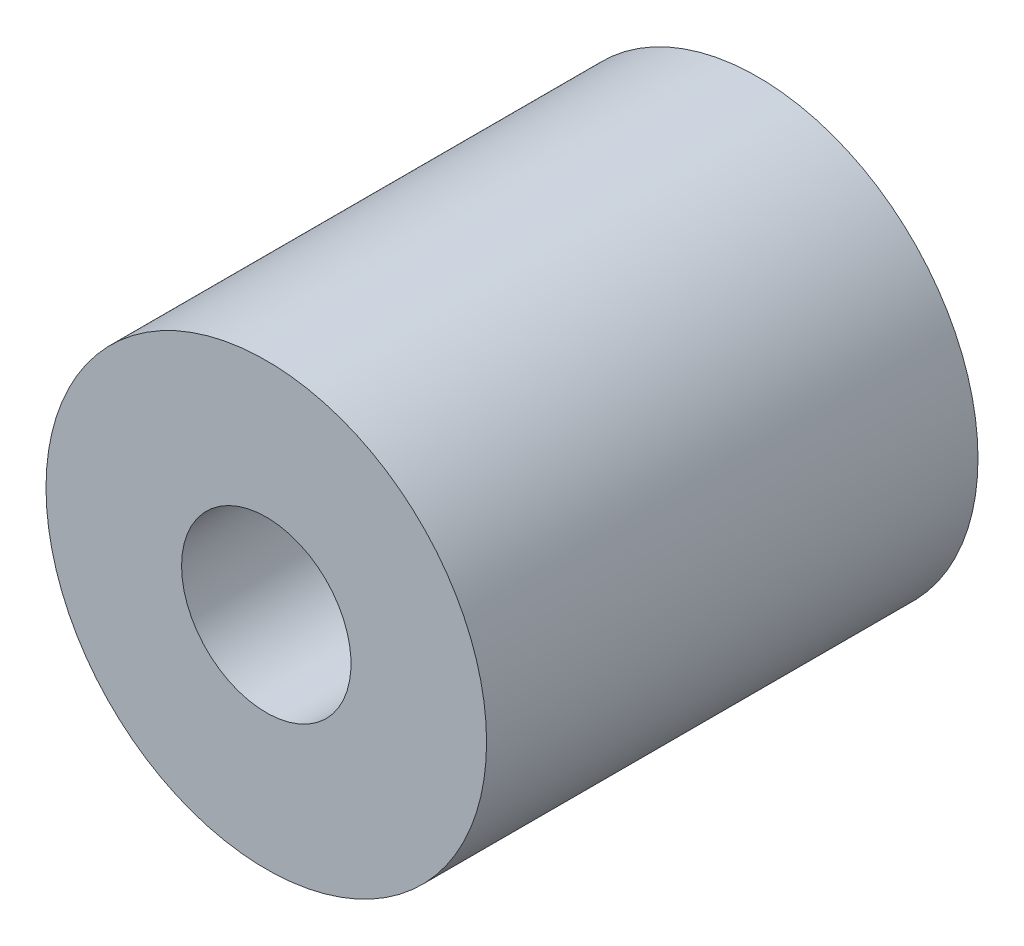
ISO-10303-21;
HEADER;
FILE_DESCRIPTION(('STEP AP214'),'2;1');
FILE_NAME('part.step','',(''),(''),'','','');
FILE_SCHEMA(('AUTOMOTIVE_DESIGN { 1 0 10303 214 1 1 1 1 }'));
ENDSEC;
DATA;
#1=APPLICATION_CONTEXT('core data for automotive mechanical design processes');
#2=APPLICATION_PROTOCOL_DEFINITION('international standard','automotive_design',2000,#1);
#3=PRODUCT_CONTEXT('',#1,'mechanical');
#4=PRODUCT('Part','Part','',(#3));
#5=PRODUCT_RELATED_PRODUCT_CATEGORY('part','',(#4));
#6=PRODUCT_DEFINITION_FORMATION('','',#4);
#7=PRODUCT_DEFINITION_CONTEXT('part definition',#1,'design');
#8=PRODUCT_DEFINITION('design','',#6,#7);
#9=PRODUCT_DEFINITION_SHAPE('','',#8);
#10=(LENGTH_UNIT() NAMED_UNIT(*) SI_UNIT(.MILLI.,.METRE.));
#11=(NAMED_UNIT(*) PLANE_ANGLE_UNIT() SI_UNIT($,.RADIAN.));
#12=(NAMED_UNIT(*) SI_UNIT($,.STERADIAN.) SOLID_ANGLE_UNIT());
#13=UNCERTAINTY_MEASURE_WITH_UNIT(LENGTH_MEASURE(1.E-05),#10,'distance_accuracy_value','');
#14=(GEOMETRIC_REPRESENTATION_CONTEXT(3) GLOBAL_UNCERTAINTY_ASSIGNED_CONTEXT((#13)) GLOBAL_UNIT_ASSIGNED_CONTEXT((#10,
#11,#12)) REPRESENTATION_CONTEXT('',''));
#15=CARTESIAN_POINT('',(0.,0.,0.));
#16=DIRECTION('',(0.,0.,1.));
#17=DIRECTION('',(1.,0.,0.));
#18=AXIS2_PLACEMENT_3D('',#15,#16,#17);
#19=CARTESIAN_POINT('',(0.,0.,36.));
#20=DIRECTION('',(0.,0.,1.));
#21=DIRECTION('',(1.,0.,0.));
#22=AXIS2_PLACEMENT_3D('',#19,#20,#21);
#23=CYLINDRICAL_SURFACE('',#22,6.5);
#24=CARTESIAN_POINT('',(0.,0.,16.));
#25=DIRECTION('',(0.,0.,1.));
#26=DIRECTION('',(1.,0.,0.));
#27=AXIS2_PLACEMENT_3D('',#24,#25,#26);
#28=CIRCLE('',#27,6.5);
#29=CARTESIAN_POINT('',(6.5,0.,16.));
#30=VERTEX_POINT('',#29);
#31=EDGE_CURVE('E8',#30,#30,#28,.T.);
#32=ORIENTED_EDGE('',*,*,#31,.F.);
#33=EDGE_LOOP('',(#32));
#34=FACE_BOUND('',#33,.T.);
#35=CARTESIAN_POINT('',(0.,0.,1.5));
#36=DIRECTION('',(0.,0.,-1.));
#37=DIRECTION('',(-1.,0.,0.));
#38=AXIS2_PLACEMENT_3D('',#35,#36,#37);
#39=CIRCLE('',#38,6.5);
#40=CARTESIAN_POINT('',(-6.5,0.,1.5));
#41=VERTEX_POINT('',#40);
#42=EDGE_CURVE('E28',#41,#41,#39,.F.);
#43=ORIENTED_EDGE('',*,*,#42,.T.);
#44=EDGE_LOOP('',(#43));
#45=FACE_BOUND('',#44,.T.);
#46=ADVANCED_FACE('F12',(#34,#45),#23,.T.);
#47=CARTESIAN_POINT('',(0.,0.,16.));
#48=DIRECTION('',(0.,0.,1.));
#49=DIRECTION('',(1.,0.,0.));
#50=AXIS2_PLACEMENT_3D('',#47,#48,#49);
#51=PLANE('',#50);
#52=ORIENTED_EDGE('',*,*,#31,.T.);
#53=EDGE_LOOP('',(#52));
#54=FACE_BOUND('',#53,.T.);
#55=CARTESIAN_POINT('',(0.,0.,16.));
#56=DIRECTION('',(0.,0.,-1.));
#57=DIRECTION('',(-1.,0.,0.));
#58=AXIS2_PLACEMENT_3D('',#55,#56,#57);
#59=CIRCLE('',#58,2.5);
#60=CARTESIAN_POINT('',(-2.5,0.,16.));
#61=VERTEX_POINT('',#60);
#62=EDGE_CURVE('E25',#61,#61,#59,.T.);
#63=ORIENTED_EDGE('',*,*,#62,.T.);
#64=EDGE_LOOP('',(#63));
#65=FACE_BOUND('',#64,.T.);
#66=ADVANCED_FACE('F41',(#54,#65),#51,.T.);
#67=CARTESIAN_POINT('',(0.,0.,9.5));
#68=DIRECTION('',(0.,0.,1.));
#69=DIRECTION('',(1.,0.,0.));
#70=AXIS2_PLACEMENT_3D('',#67,#68,#69);
#71=CYLINDRICAL_SURFACE('',#70,2.5);
#72=CARTESIAN_POINT('',(0.,0.,9.5));
#73=DIRECTION('',(0.,0.,-1.));
#74=DIRECTION('',(-1.,0.,0.));
#75=AXIS2_PLACEMENT_3D('',#72,#73,#74);
#76=CIRCLE('',#75,2.5);
#77=CARTESIAN_POINT('',(-2.5,0.,9.5));
#78=VERTEX_POINT('',#77);
#79=EDGE_CURVE('E20',#78,#78,#76,.T.);
#80=ORIENTED_EDGE('',*,*,#79,.T.);
#81=EDGE_LOOP('',(#80));
#82=FACE_BOUND('',#81,.T.);
#83=ORIENTED_EDGE('',*,*,#62,.F.);
#84=EDGE_LOOP('',(#83));
#85=FACE_BOUND('',#84,.T.);
#86=ADVANCED_FACE('F43',(#82,#85),#71,.F.);
#87=CARTESIAN_POINT('',(0.,0.,9.5));
#88=DIRECTION('',(0.,0.,-1.));
#89=DIRECTION('',(-1.,0.,0.));
#90=AXIS2_PLACEMENT_3D('',#87,#88,#89);
#91=PLANE('',#90);
#92=ORIENTED_EDGE('',*,*,#79,.F.);
#93=EDGE_LOOP('',(#92));
#94=FACE_BOUND('',#93,.T.);
#95=ADVANCED_FACE('F45',(#94),#91,.F.);
#96=CARTESIAN_POINT('',(0.,0.,-24.));
#97=DIRECTION('',(0.,0.,-1.));
#98=DIRECTION('',(-1.,0.,0.));
#99=AXIS2_PLACEMENT_3D('',#96,#97,#98);
#100=CYLINDRICAL_SURFACE('',#99,4.25);
#101=CARTESIAN_POINT('',(0.,0.,0.));
#102=DIRECTION('',(0.,0.,-1.));
#103=DIRECTION('',(-1.,0.,0.));
#104=AXIS2_PLACEMENT_3D('',#101,#102,#103);
#105=CIRCLE('',#104,4.25);
#106=CARTESIAN_POINT('',(-4.25,0.,0.));
#107=VERTEX_POINT('',#106);
#108=EDGE_CURVE('E16',#107,#107,#105,.F.);
#109=ORIENTED_EDGE('',*,*,#108,.T.);
#110=EDGE_LOOP('',(#109));
#111=FACE_BOUND('',#110,.T.);
#112=CARTESIAN_POINT('',(0.,0.,1.5));
#113=DIRECTION('',(0.,0.,-1.));
#114=DIRECTION('',(-1.,0.,0.));
#115=AXIS2_PLACEMENT_3D('',#112,#113,#114);
#116=CIRCLE('',#115,4.25);
#117=CARTESIAN_POINT('',(-4.25,0.,1.5));
#118=VERTEX_POINT('',#117);
#119=EDGE_CURVE('E30',#118,#118,#116,.T.);
#120=ORIENTED_EDGE('',*,*,#119,.T.);
#121=EDGE_LOOP('',(#120));
#122=FACE_BOUND('',#121,.T.);
#123=ADVANCED_FACE('F48',(#111,#122),#100,.T.);
#124=CARTESIAN_POINT('',(0.,4.25,1.5));
#125=DIRECTION('',(0.,0.,-1.));
#126=DIRECTION('',(-1.,0.,0.));
#127=AXIS2_PLACEMENT_3D('',#124,#125,#126);
#128=PLANE('',#127);
#129=ORIENTED_EDGE('',*,*,#42,.F.);
#130=EDGE_LOOP('',(#129));
#131=FACE_BOUND('',#130,.T.);
#132=ORIENTED_EDGE('',*,*,#119,.F.);
#133=EDGE_LOOP('',(#132));
#134=FACE_BOUND('',#133,.T.);
#135=ADVANCED_FACE('F58',(#131,#134),#128,.T.);
#136=CARTESIAN_POINT('',(6.5,0.,0.));
#137=DIRECTION('',(0.,0.,-1.));
#138=DIRECTION('',(-1.,0.,0.));
#139=AXIS2_PLACEMENT_3D('',#136,#137,#138);
#140=PLANE('',#139);
#141=ORIENTED_EDGE('',*,*,#108,.F.);
#142=EDGE_LOOP('',(#141));
#143=FACE_BOUND('',#142,.T.);
#144=ADVANCED_FACE('F14',(#143),#140,.T.);
#145=CLOSED_SHELL('',(#46,#66,#86,#95,#123,#135,#144));
#146=MANIFOLD_SOLID_BREP('B1',#145);
#147=ADVANCED_BREP_SHAPE_REPRESENTATION('',(#18,#146),#14);
#148=SHAPE_DEFINITION_REPRESENTATION(#9,#147);
ENDSEC;
END-ISO-10303-21;
